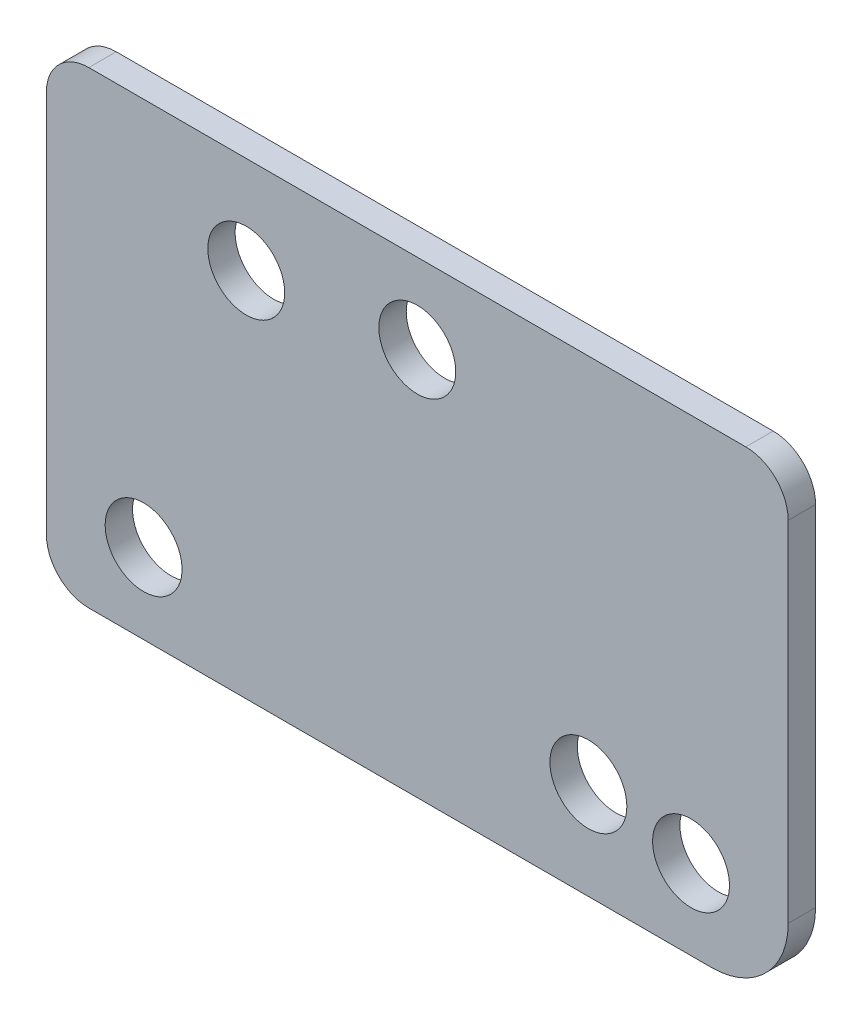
from build123d import *

# Parameters (mm, degrees)
BOSS_EXTRUDE1_DEPTH = 2.54
HOLE1_D             = 7.1374
HOLE11_D            = 7.1374


with BuildPart() as part:
    # Sketch2 → Boss-Extrude1 (new body)
    with BuildSketch(Plane(origin=(0, 0, 82.1182), x_dir=(-1, 0, 0), z_dir=(0, 0, -1))):
        with BuildLine():
            Line((901.985295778, -48.730406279), (901.985295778, -13.170406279))
            ThreePointArc((901.985295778, -13.170406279), (900.832175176, -10.386526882), (898.048295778, -9.233406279))
            Line((898.048295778, -9.233406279), (837.088295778, -9.233406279))
            ThreePointArc((837.088295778, -9.233406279), (834.304416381, -10.386526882), (833.151295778, -13.170406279))
            Line((833.151295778, -13.170406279), (833.151295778, -45.555406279))
            ThreePointArc((833.151295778, -45.555406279), (835.23435235, -50.584349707), (840.263295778, -52.667406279))
            Line((840.263295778, -52.667406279), (898.048295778, -52.667406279))
            ThreePointArc((898.048295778, -52.667406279), (900.832175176, -51.514285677), (901.985295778, -48.730406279))
        make_face()
    extrude(amount=-BOSS_EXTRUDE1_DEPTH)

    # Hole1 (through all)
    with Locations(Plane(origin=(-838.514035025, -34.636765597, 82.1182), x_dir=(-1, 0, 0), z_dir=(0, 0, -1))):
        with Locations((3.654260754, -10.601140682), (54.454260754, -10.601140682), (29.054260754, 17.973859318)):
            Hole(HOLE1_D / 2)

    # Hole11 (through all)
    with Locations(Plane(origin=(-855.347556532, -33.049265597, 84.6582), x_dir=(1, 0, 0), z_dir=(0, 0, 1))):
        with Locations((3.654260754, -10.601140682), (-28.095739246, 14.798859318)):
            Hole(HOLE11_D / 2)


solid = part.part
